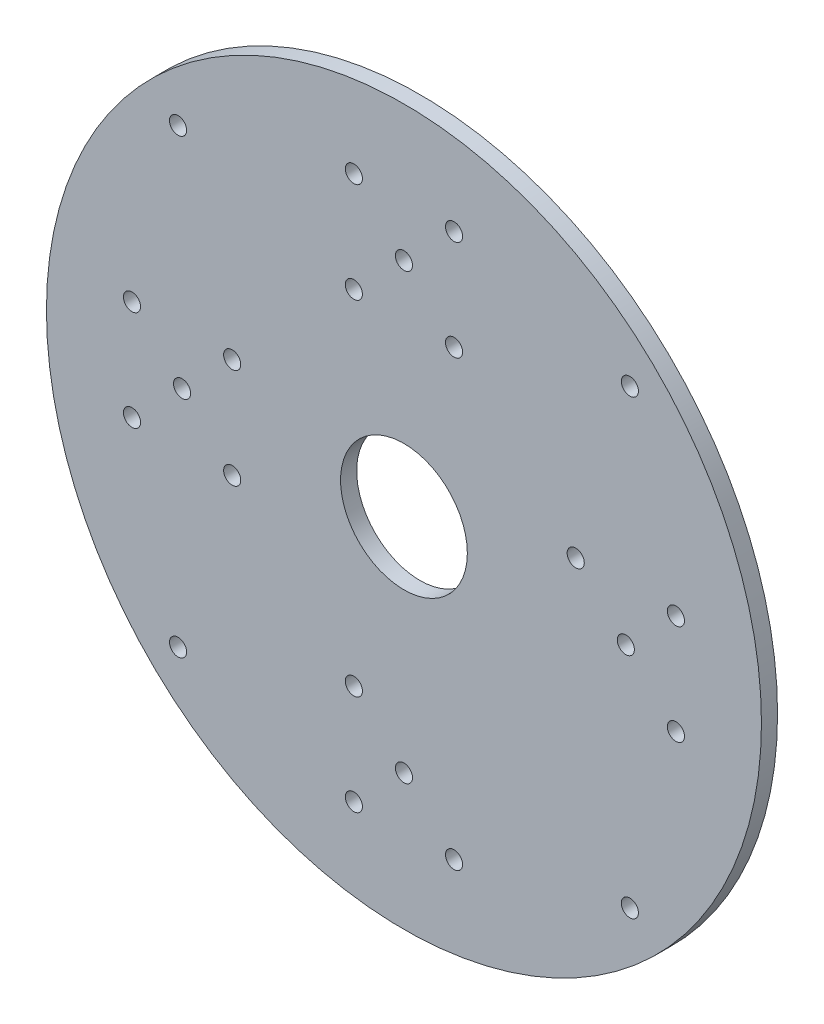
ISO-10303-21;
HEADER;
FILE_DESCRIPTION(('STEP AP214'),'2;1');
FILE_NAME('part.step','',(''),(''),'','','');
FILE_SCHEMA(('AUTOMOTIVE_DESIGN { 1 0 10303 214 1 1 1 1 }'));
ENDSEC;
DATA;
#1=APPLICATION_CONTEXT('core data for automotive mechanical design processes');
#2=APPLICATION_PROTOCOL_DEFINITION('international standard','automotive_design',2000,#1);
#3=PRODUCT_CONTEXT('',#1,'mechanical');
#4=PRODUCT('Part','Part','',(#3));
#5=PRODUCT_RELATED_PRODUCT_CATEGORY('part','',(#4));
#6=PRODUCT_DEFINITION_FORMATION('','',#4);
#7=PRODUCT_DEFINITION_CONTEXT('part definition',#1,'design');
#8=PRODUCT_DEFINITION('design','',#6,#7);
#9=PRODUCT_DEFINITION_SHAPE('','',#8);
#10=(LENGTH_UNIT() NAMED_UNIT(*) SI_UNIT(.MILLI.,.METRE.));
#11=(NAMED_UNIT(*) PLANE_ANGLE_UNIT() SI_UNIT($,.RADIAN.));
#12=(NAMED_UNIT(*) SI_UNIT($,.STERADIAN.) SOLID_ANGLE_UNIT());
#13=UNCERTAINTY_MEASURE_WITH_UNIT(LENGTH_MEASURE(1.E-05),#10,'distance_accuracy_value','');
#14=(GEOMETRIC_REPRESENTATION_CONTEXT(3) GLOBAL_UNCERTAINTY_ASSIGNED_CONTEXT((#13)) GLOBAL_UNIT_ASSIGNED_CONTEXT((#10,
#11,#12)) REPRESENTATION_CONTEXT('',''));
#15=CARTESIAN_POINT('',(0.,0.,0.));
#16=DIRECTION('',(0.,0.,1.));
#17=DIRECTION('',(1.,0.,0.));
#18=AXIS2_PLACEMENT_3D('',#15,#16,#17);
#19=CARTESIAN_POINT('',(0.,0.,6.35));
#20=DIRECTION('',(0.,0.,1.));
#21=DIRECTION('',(1.,0.,0.));
#22=AXIS2_PLACEMENT_3D('',#19,#20,#21);
#23=PLANE('',#22);
#24=CARTESIAN_POINT('',(-9.16513851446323E-13,-87.5,6.35));
#25=DIRECTION('',(0.,0.,1.));
#26=DIRECTION('',(1.,0.,0.));
#27=AXIS2_PLACEMENT_3D('',#24,#25,#26);
#28=CIRCLE('',#27,3.37819999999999);
#29=CARTESIAN_POINT('',(3.37819999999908,-87.5,6.35));
#30=VERTEX_POINT('',#29);
#31=EDGE_CURVE('E285',#30,#30,#28,.T.);
#32=ORIENTED_EDGE('',*,*,#31,.F.);
#33=EDGE_LOOP('',(#32));
#34=FACE_BOUND('',#33,.T.);
#35=CARTESIAN_POINT('',(3.05504617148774E-13,87.5,6.35));
#36=DIRECTION('',(0.,0.,1.));
#37=DIRECTION('',(1.,0.,0.));
#38=AXIS2_PLACEMENT_3D('',#35,#36,#37);
#39=CIRCLE('',#38,3.37819999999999);
#40=CARTESIAN_POINT('',(3.3782000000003,87.5,6.35));
#41=VERTEX_POINT('',#40);
#42=EDGE_CURVE('E93',#41,#41,#39,.T.);
#43=ORIENTED_EDGE('',*,*,#42,.F.);
#44=EDGE_LOOP('',(#43));
#45=FACE_BOUND('',#44,.T.);
#46=CARTESIAN_POINT('',(89.0954544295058,89.0954544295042,6.35));
#47=DIRECTION('',(0.,0.,1.));
#48=DIRECTION('',(1.,0.,0.));
#49=AXIS2_PLACEMENT_3D('',#46,#47,#48);
#50=CIRCLE('',#49,3.37819999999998);
#51=CARTESIAN_POINT('',(92.4736544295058,89.0954544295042,6.35));
#52=VERTEX_POINT('',#51);
#53=EDGE_CURVE('E167',#52,#52,#50,.T.);
#54=ORIENTED_EDGE('',*,*,#53,.F.);
#55=EDGE_LOOP('',(#54));
#56=FACE_BOUND('',#55,.T.);
#57=CARTESIAN_POINT('',(-89.0954544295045,89.0954544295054,6.35));
#58=DIRECTION('',(0.,0.,1.));
#59=DIRECTION('',(1.,0.,0.));
#60=AXIS2_PLACEMENT_3D('',#57,#58,#59);
#61=CIRCLE('',#60,3.3782);
#62=CARTESIAN_POINT('',(-85.7172544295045,89.0954544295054,6.35));
#63=VERTEX_POINT('',#62);
#64=EDGE_CURVE('E172',#63,#63,#61,.T.);
#65=ORIENTED_EDGE('',*,*,#64,.F.);
#66=EDGE_LOOP('',(#65));
#67=FACE_BOUND('',#66,.T.);
#68=CARTESIAN_POINT('',(-89.0954544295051,-89.0954544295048,6.35));
#69=DIRECTION('',(0.,0.,1.));
#70=DIRECTION('',(1.,0.,0.));
#71=AXIS2_PLACEMENT_3D('',#68,#69,#70);
#72=CIRCLE('',#71,3.37819999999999);
#73=CARTESIAN_POINT('',(-85.7172544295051,-89.0954544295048,6.35));
#74=VERTEX_POINT('',#73);
#75=EDGE_CURVE('E178',#74,#74,#72,.T.);
#76=ORIENTED_EDGE('',*,*,#75,.F.);
#77=EDGE_LOOP('',(#76));
#78=FACE_BOUND('',#77,.T.);
#79=CARTESIAN_POINT('',(-19.7565634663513,67.7434365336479,6.35));
#80=DIRECTION('',(0.,0.,1.));
#81=DIRECTION('',(1.,0.,0.));
#82=AXIS2_PLACEMENT_3D('',#79,#80,#81);
#83=CIRCLE('',#82,3.37819999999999);
#84=CARTESIAN_POINT('',(-16.3783634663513,67.7434365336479,6.35));
#85=VERTEX_POINT('',#84);
#86=EDGE_CURVE('E187',#85,#85,#83,.F.);
#87=ORIENTED_EDGE('',*,*,#86,.T.);
#88=EDGE_LOOP('',(#87));
#89=FACE_BOUND('',#88,.T.);
#90=CARTESIAN_POINT('',(0.,0.,6.35));
#91=DIRECTION('',(0.,0.,1.));
#92=DIRECTION('',(1.,0.,0.));
#93=AXIS2_PLACEMENT_3D('',#90,#91,#92);
#94=CIRCLE('',#93,25.);
#95=CARTESIAN_POINT('',(25.,0.,6.35));
#96=VERTEX_POINT('',#95);
#97=EDGE_CURVE('E191',#96,#96,#94,.T.);
#98=ORIENTED_EDGE('',*,*,#97,.F.);
#99=EDGE_LOOP('',(#98));
#100=FACE_BOUND('',#99,.T.);
#101=CARTESIAN_POINT('',(-67.7434365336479,-19.7565634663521,6.35));
#102=DIRECTION('',(0.,0.,1.));
#103=DIRECTION('',(1.,0.,0.));
#104=AXIS2_PLACEMENT_3D('',#101,#102,#103);
#105=CIRCLE('',#104,3.37819999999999);
#106=CARTESIAN_POINT('',(-64.3652365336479,-19.7565634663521,6.35));
#107=VERTEX_POINT('',#106);
#108=EDGE_CURVE('E195',#107,#107,#105,.T.);
#109=ORIENTED_EDGE('',*,*,#108,.F.);
#110=EDGE_LOOP('',(#109));
#111=FACE_BOUND('',#110,.T.);
#112=CARTESIAN_POINT('',(-67.7434365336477,19.7565634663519,6.35));
#113=DIRECTION('',(0.,0.,1.));
#114=DIRECTION('',(1.,0.,0.));
#115=AXIS2_PLACEMENT_3D('',#112,#113,#114);
#116=CIRCLE('',#115,3.37819999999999);
#117=CARTESIAN_POINT('',(-64.3652365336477,19.7565634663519,6.35));
#118=VERTEX_POINT('',#117);
#119=EDGE_CURVE('E199',#118,#118,#116,.T.);
#120=ORIENTED_EDGE('',*,*,#119,.F.);
#121=EDGE_LOOP('',(#120));
#122=FACE_BOUND('',#121,.T.);
#123=CARTESIAN_POINT('',(19.7565634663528,67.7434365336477,6.35));
#124=DIRECTION('',(0.,0.,1.));
#125=DIRECTION('',(1.,0.,0.));
#126=AXIS2_PLACEMENT_3D('',#123,#124,#125);
#127=CIRCLE('',#126,3.37819999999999);
#128=CARTESIAN_POINT('',(23.1347634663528,67.7434365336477,6.35));
#129=VERTEX_POINT('',#128);
#130=EDGE_CURVE('E203',#129,#129,#127,.F.);
#131=ORIENTED_EDGE('',*,*,#130,.T.);
#132=EDGE_LOOP('',(#131));
#133=FACE_BOUND('',#132,.T.);
#134=CARTESIAN_POINT('',(67.7434365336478,19.7565634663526,6.35));
#135=DIRECTION('',(0.,0.,1.));
#136=DIRECTION('',(1.,0.,0.));
#137=AXIS2_PLACEMENT_3D('',#134,#135,#136);
#138=CIRCLE('',#137,3.37819999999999);
#139=CARTESIAN_POINT('',(71.1216365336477,19.7565634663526,6.35));
#140=VERTEX_POINT('',#139);
#141=EDGE_CURVE('E207',#140,#140,#138,.T.);
#142=ORIENTED_EDGE('',*,*,#141,.F.);
#143=EDGE_LOOP('',(#142));
#144=FACE_BOUND('',#143,.T.);
#145=CARTESIAN_POINT('',(-19.7565634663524,-67.7434365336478,6.35));
#146=DIRECTION('',(0.,0.,1.));
#147=DIRECTION('',(1.,0.,0.));
#148=AXIS2_PLACEMENT_3D('',#145,#146,#147);
#149=CIRCLE('',#148,3.37819999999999);
#150=CARTESIAN_POINT('',(-16.3783634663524,-67.7434365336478,6.35));
#151=VERTEX_POINT('',#150);
#152=EDGE_CURVE('E211',#151,#151,#149,.F.);
#153=ORIENTED_EDGE('',*,*,#152,.T.);
#154=EDGE_LOOP('',(#153));
#155=FACE_BOUND('',#154,.T.);
#156=CARTESIAN_POINT('',(19.7565634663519,-107.256563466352,6.35));
#157=DIRECTION('',(0.,0.,1.));
#158=DIRECTION('',(1.,0.,0.));
#159=AXIS2_PLACEMENT_3D('',#156,#157,#158);
#160=CIRCLE('',#159,3.3782);
#161=CARTESIAN_POINT('',(23.1347634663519,-107.256563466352,6.35));
#162=VERTEX_POINT('',#161);
#163=EDGE_CURVE('E215',#162,#162,#160,.F.);
#164=ORIENTED_EDGE('',*,*,#163,.T.);
#165=EDGE_LOOP('',(#164));
#166=FACE_BOUND('',#165,.T.);
#167=CARTESIAN_POINT('',(107.256563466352,-19.7565634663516,6.35));
#168=DIRECTION('',(0.,0.,1.));
#169=DIRECTION('',(1.,0.,0.));
#170=AXIS2_PLACEMENT_3D('',#167,#168,#169);
#171=CIRCLE('',#170,3.37820000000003);
#172=CARTESIAN_POINT('',(110.634763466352,-19.7565634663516,6.35));
#173=VERTEX_POINT('',#172);
#174=EDGE_CURVE('E219',#173,#173,#171,.T.);
#175=ORIENTED_EDGE('',*,*,#174,.F.);
#176=EDGE_LOOP('',(#175));
#177=FACE_BOUND('',#176,.T.);
#178=CARTESIAN_POINT('',(107.256563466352,19.7565634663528,6.35));
#179=DIRECTION('',(0.,0.,1.));
#180=DIRECTION('',(1.,0.,0.));
#181=AXIS2_PLACEMENT_3D('',#178,#179,#180);
#182=CIRCLE('',#181,3.37819999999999);
#183=CARTESIAN_POINT('',(110.634763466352,19.7565634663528,6.35));
#184=VERTEX_POINT('',#183);
#185=EDGE_CURVE('E223',#184,#184,#182,.T.);
#186=ORIENTED_EDGE('',*,*,#185,.F.);
#187=EDGE_LOOP('',(#186));
#188=FACE_BOUND('',#187,.T.);
#189=CARTESIAN_POINT('',(-19.7565634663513,107.256563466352,6.35));
#190=DIRECTION('',(0.,0.,1.));
#191=DIRECTION('',(1.,0.,0.));
#192=AXIS2_PLACEMENT_3D('',#189,#190,#191);
#193=CIRCLE('',#192,3.37820000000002);
#194=CARTESIAN_POINT('',(-16.3783634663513,107.256563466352,6.35));
#195=VERTEX_POINT('',#194);
#196=EDGE_CURVE('E227',#195,#195,#193,.F.);
#197=ORIENTED_EDGE('',*,*,#196,.T.);
#198=EDGE_LOOP('',(#197));
#199=FACE_BOUND('',#198,.T.);
#200=CARTESIAN_POINT('',(-107.256563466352,19.7565634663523,6.35));
#201=DIRECTION('',(0.,0.,1.));
#202=DIRECTION('',(1.,0.,0.));
#203=AXIS2_PLACEMENT_3D('',#200,#201,#202);
#204=CIRCLE('',#203,3.37819999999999);
#205=CARTESIAN_POINT('',(-103.878363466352,19.7565634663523,6.35));
#206=VERTEX_POINT('',#205);
#207=EDGE_CURVE('E231',#206,#206,#204,.T.);
#208=ORIENTED_EDGE('',*,*,#207,.F.);
#209=EDGE_LOOP('',(#208));
#210=FACE_BOUND('',#209,.T.);
#211=CARTESIAN_POINT('',(-107.256563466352,-19.7565634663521,6.35));
#212=DIRECTION('',(0.,0.,1.));
#213=DIRECTION('',(1.,0.,0.));
#214=AXIS2_PLACEMENT_3D('',#211,#212,#213);
#215=CIRCLE('',#214,3.37819999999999);
#216=CARTESIAN_POINT('',(-103.878363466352,-19.7565634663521,6.35));
#217=VERTEX_POINT('',#216);
#218=EDGE_CURVE('E235',#217,#217,#215,.T.);
#219=ORIENTED_EDGE('',*,*,#218,.F.);
#220=EDGE_LOOP('',(#219));
#221=FACE_BOUND('',#220,.T.);
#222=CARTESIAN_POINT('',(89.0954544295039,-89.095454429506,6.35));
#223=DIRECTION('',(0.,0.,1.));
#224=DIRECTION('',(1.,0.,0.));
#225=AXIS2_PLACEMENT_3D('',#222,#223,#224);
#226=CIRCLE('',#225,3.3782);
#227=CARTESIAN_POINT('',(92.4736544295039,-89.095454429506,6.35));
#228=VERTEX_POINT('',#227);
#229=EDGE_CURVE('E239',#228,#228,#226,.T.);
#230=ORIENTED_EDGE('',*,*,#229,.F.);
#231=EDGE_LOOP('',(#230));
#232=FACE_BOUND('',#231,.T.);
#233=CARTESIAN_POINT('',(19.7565634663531,107.256563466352,6.35));
#234=DIRECTION('',(0.,0.,1.));
#235=DIRECTION('',(1.,0.,0.));
#236=AXIS2_PLACEMENT_3D('',#233,#234,#235);
#237=CIRCLE('',#236,3.3782);
#238=CARTESIAN_POINT('',(23.1347634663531,107.256563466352,6.35));
#239=VERTEX_POINT('',#238);
#240=EDGE_CURVE('E84',#239,#239,#237,.F.);
#241=ORIENTED_EDGE('',*,*,#240,.T.);
#242=EDGE_LOOP('',(#241));
#243=FACE_BOUND('',#242,.T.);
#244=CARTESIAN_POINT('',(-19.7565634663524,-107.256563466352,6.35));
#245=DIRECTION('',(0.,0.,1.));
#246=DIRECTION('',(1.,0.,0.));
#247=AXIS2_PLACEMENT_3D('',#244,#245,#246);
#248=CIRCLE('',#247,3.37819999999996);
#249=CARTESIAN_POINT('',(-16.3783634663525,-107.256563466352,6.35));
#250=VERTEX_POINT('',#249);
#251=EDGE_CURVE('E78',#250,#250,#248,.F.);
#252=ORIENTED_EDGE('',*,*,#251,.T.);
#253=EDGE_LOOP('',(#252));
#254=FACE_BOUND('',#253,.T.);
#255=CARTESIAN_POINT('',(0.,0.,6.35));
#256=DIRECTION('',(0.,0.,1.));
#257=DIRECTION('',(1.,0.,0.));
#258=AXIS2_PLACEMENT_3D('',#255,#256,#257);
#259=CIRCLE('',#258,141.);
#260=CARTESIAN_POINT('',(141.,0.,6.35));
#261=VERTEX_POINT('',#260);
#262=EDGE_CURVE('E11',#261,#261,#259,.T.);
#263=ORIENTED_EDGE('',*,*,#262,.T.);
#264=EDGE_LOOP('',(#263));
#265=FACE_BOUND('',#264,.T.);
#266=CARTESIAN_POINT('',(87.5,-6.11009234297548E-13,6.35));
#267=DIRECTION('',(0.,0.,1.));
#268=DIRECTION('',(1.,0.,0.));
#269=AXIS2_PLACEMENT_3D('',#266,#267,#268);
#270=CIRCLE('',#269,3.3782);
#271=CARTESIAN_POINT('',(90.8782,-6.11009234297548E-13,6.35));
#272=VERTEX_POINT('',#271);
#273=EDGE_CURVE('E291',#272,#272,#270,.T.);
#274=ORIENTED_EDGE('',*,*,#273,.F.);
#275=EDGE_LOOP('',(#274));
#276=FACE_BOUND('',#275,.T.);
#277=CARTESIAN_POINT('',(-87.5,0.,6.35));
#278=DIRECTION('',(0.,0.,1.));
#279=DIRECTION('',(1.,0.,0.));
#280=AXIS2_PLACEMENT_3D('',#277,#278,#279);
#281=CIRCLE('',#280,3.3782);
#282=CARTESIAN_POINT('',(-84.1218,0.,6.35));
#283=VERTEX_POINT('',#282);
#284=EDGE_CURVE('E279',#283,#283,#281,.T.);
#285=ORIENTED_EDGE('',*,*,#284,.F.);
#286=EDGE_LOOP('',(#285));
#287=FACE_BOUND('',#286,.T.);
#288=ADVANCED_FACE('F69',(#34,#45,#56,#67,#78,#89,#100,#111,#122,#133,#144,#155,#166,#177,#188,
#199,#210,#221,#232,#243,#254,#265,#276,#287),#23,.T.);
#289=CARTESIAN_POINT('',(0.,0.,0.));
#290=DIRECTION('',(0.,0.,1.));
#291=DIRECTION('',(1.,0.,0.));
#292=AXIS2_PLACEMENT_3D('',#289,#290,#291);
#293=PLANE('',#292);
#294=CARTESIAN_POINT('',(89.0954544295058,89.0954544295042,0.));
#295=DIRECTION('',(0.,0.,1.));
#296=DIRECTION('',(1.,0.,0.));
#297=AXIS2_PLACEMENT_3D('',#294,#295,#296);
#298=CIRCLE('',#297,3.37819999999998);
#299=CARTESIAN_POINT('',(92.4736544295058,89.0954544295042,0.));
#300=VERTEX_POINT('',#299);
#301=EDGE_CURVE('E88',#300,#300,#298,.T.);
#302=ORIENTED_EDGE('',*,*,#301,.T.);
#303=EDGE_LOOP('',(#302));
#304=FACE_BOUND('',#303,.T.);
#305=CARTESIAN_POINT('',(-89.0954544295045,89.0954544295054,0.));
#306=DIRECTION('',(0.,0.,1.));
#307=DIRECTION('',(1.,0.,0.));
#308=AXIS2_PLACEMENT_3D('',#305,#306,#307);
#309=CIRCLE('',#308,3.3782);
#310=CARTESIAN_POINT('',(-85.7172544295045,89.0954544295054,0.));
#311=VERTEX_POINT('',#310);
#312=EDGE_CURVE('E92',#311,#311,#309,.T.);
#313=ORIENTED_EDGE('',*,*,#312,.T.);
#314=EDGE_LOOP('',(#313));
#315=FACE_BOUND('',#314,.T.);
#316=CARTESIAN_POINT('',(-89.0954544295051,-89.0954544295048,0.));
#317=DIRECTION('',(0.,0.,1.));
#318=DIRECTION('',(1.,0.,0.));
#319=AXIS2_PLACEMENT_3D('',#316,#317,#318);
#320=CIRCLE('',#319,3.37819999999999);
#321=CARTESIAN_POINT('',(-85.7172544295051,-89.0954544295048,0.));
#322=VERTEX_POINT('',#321);
#323=EDGE_CURVE('E97',#322,#322,#320,.T.);
#324=ORIENTED_EDGE('',*,*,#323,.T.);
#325=EDGE_LOOP('',(#324));
#326=FACE_BOUND('',#325,.T.);
#327=CARTESIAN_POINT('',(-19.7565634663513,67.7434365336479,0.));
#328=DIRECTION('',(0.,0.,1.));
#329=DIRECTION('',(1.,0.,0.));
#330=AXIS2_PLACEMENT_3D('',#327,#328,#329);
#331=CIRCLE('',#330,3.37819999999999);
#332=CARTESIAN_POINT('',(-16.3783634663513,67.7434365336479,0.));
#333=VERTEX_POINT('',#332);
#334=EDGE_CURVE('E101',#333,#333,#331,.F.);
#335=ORIENTED_EDGE('',*,*,#334,.F.);
#336=EDGE_LOOP('',(#335));
#337=FACE_BOUND('',#336,.T.);
#338=CARTESIAN_POINT('',(0.,0.,0.));
#339=DIRECTION('',(0.,0.,1.));
#340=DIRECTION('',(1.,0.,0.));
#341=AXIS2_PLACEMENT_3D('',#338,#339,#340);
#342=CIRCLE('',#341,25.);
#343=CARTESIAN_POINT('',(25.,0.,0.));
#344=VERTEX_POINT('',#343);
#345=EDGE_CURVE('E105',#344,#344,#342,.T.);
#346=ORIENTED_EDGE('',*,*,#345,.T.);
#347=EDGE_LOOP('',(#346));
#348=FACE_BOUND('',#347,.T.);
#349=CARTESIAN_POINT('',(-67.7434365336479,-19.7565634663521,0.));
#350=DIRECTION('',(0.,0.,1.));
#351=DIRECTION('',(1.,0.,0.));
#352=AXIS2_PLACEMENT_3D('',#349,#350,#351);
#353=CIRCLE('',#352,3.37819999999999);
#354=CARTESIAN_POINT('',(-64.3652365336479,-19.7565634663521,0.));
#355=VERTEX_POINT('',#354);
#356=EDGE_CURVE('E109',#355,#355,#353,.T.);
#357=ORIENTED_EDGE('',*,*,#356,.T.);
#358=EDGE_LOOP('',(#357));
#359=FACE_BOUND('',#358,.T.);
#360=CARTESIAN_POINT('',(-67.7434365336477,19.7565634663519,0.));
#361=DIRECTION('',(0.,0.,1.));
#362=DIRECTION('',(1.,0.,0.));
#363=AXIS2_PLACEMENT_3D('',#360,#361,#362);
#364=CIRCLE('',#363,3.37819999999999);
#365=CARTESIAN_POINT('',(-64.3652365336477,19.7565634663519,0.));
#366=VERTEX_POINT('',#365);
#367=EDGE_CURVE('E113',#366,#366,#364,.T.);
#368=ORIENTED_EDGE('',*,*,#367,.T.);
#369=EDGE_LOOP('',(#368));
#370=FACE_BOUND('',#369,.T.);
#371=CARTESIAN_POINT('',(19.7565634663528,67.7434365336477,0.));
#372=DIRECTION('',(0.,0.,1.));
#373=DIRECTION('',(1.,0.,0.));
#374=AXIS2_PLACEMENT_3D('',#371,#372,#373);
#375=CIRCLE('',#374,3.37819999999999);
#376=CARTESIAN_POINT('',(23.1347634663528,67.7434365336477,0.));
#377=VERTEX_POINT('',#376);
#378=EDGE_CURVE('E117',#377,#377,#375,.F.);
#379=ORIENTED_EDGE('',*,*,#378,.F.);
#380=EDGE_LOOP('',(#379));
#381=FACE_BOUND('',#380,.T.);
#382=CARTESIAN_POINT('',(67.7434365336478,19.7565634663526,0.));
#383=DIRECTION('',(0.,0.,1.));
#384=DIRECTION('',(1.,0.,0.));
#385=AXIS2_PLACEMENT_3D('',#382,#383,#384);
#386=CIRCLE('',#385,3.37819999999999);
#387=CARTESIAN_POINT('',(71.1216365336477,19.7565634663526,0.));
#388=VERTEX_POINT('',#387);
#389=EDGE_CURVE('E121',#388,#388,#386,.T.);
#390=ORIENTED_EDGE('',*,*,#389,.T.);
#391=EDGE_LOOP('',(#390));
#392=FACE_BOUND('',#391,.T.);
#393=CARTESIAN_POINT('',(-19.7565634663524,-67.7434365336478,0.));
#394=DIRECTION('',(0.,0.,1.));
#395=DIRECTION('',(1.,0.,0.));
#396=AXIS2_PLACEMENT_3D('',#393,#394,#395);
#397=CIRCLE('',#396,3.37819999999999);
#398=CARTESIAN_POINT('',(-16.3783634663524,-67.7434365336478,0.));
#399=VERTEX_POINT('',#398);
#400=EDGE_CURVE('E125',#399,#399,#397,.F.);
#401=ORIENTED_EDGE('',*,*,#400,.F.);
#402=EDGE_LOOP('',(#401));
#403=FACE_BOUND('',#402,.T.);
#404=CARTESIAN_POINT('',(19.7565634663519,-107.256563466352,0.));
#405=DIRECTION('',(0.,0.,1.));
#406=DIRECTION('',(1.,0.,0.));
#407=AXIS2_PLACEMENT_3D('',#404,#405,#406);
#408=CIRCLE('',#407,3.3782);
#409=CARTESIAN_POINT('',(23.1347634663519,-107.256563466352,0.));
#410=VERTEX_POINT('',#409);
#411=EDGE_CURVE('E129',#410,#410,#408,.F.);
#412=ORIENTED_EDGE('',*,*,#411,.F.);
#413=EDGE_LOOP('',(#412));
#414=FACE_BOUND('',#413,.T.);
#415=CARTESIAN_POINT('',(107.256563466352,-19.7565634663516,0.));
#416=DIRECTION('',(0.,0.,1.));
#417=DIRECTION('',(1.,0.,0.));
#418=AXIS2_PLACEMENT_3D('',#415,#416,#417);
#419=CIRCLE('',#418,3.37820000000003);
#420=CARTESIAN_POINT('',(110.634763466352,-19.7565634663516,0.));
#421=VERTEX_POINT('',#420);
#422=EDGE_CURVE('E133',#421,#421,#419,.T.);
#423=ORIENTED_EDGE('',*,*,#422,.T.);
#424=EDGE_LOOP('',(#423));
#425=FACE_BOUND('',#424,.T.);
#426=CARTESIAN_POINT('',(107.256563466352,19.7565634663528,0.));
#427=DIRECTION('',(0.,0.,1.));
#428=DIRECTION('',(1.,0.,0.));
#429=AXIS2_PLACEMENT_3D('',#426,#427,#428);
#430=CIRCLE('',#429,3.37819999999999);
#431=CARTESIAN_POINT('',(110.634763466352,19.7565634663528,0.));
#432=VERTEX_POINT('',#431);
#433=EDGE_CURVE('E137',#432,#432,#430,.T.);
#434=ORIENTED_EDGE('',*,*,#433,.T.);
#435=EDGE_LOOP('',(#434));
#436=FACE_BOUND('',#435,.T.);
#437=CARTESIAN_POINT('',(-19.7565634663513,107.256563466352,0.));
#438=DIRECTION('',(0.,0.,1.));
#439=DIRECTION('',(1.,0.,0.));
#440=AXIS2_PLACEMENT_3D('',#437,#438,#439);
#441=CIRCLE('',#440,3.37820000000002);
#442=CARTESIAN_POINT('',(-16.3783634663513,107.256563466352,0.));
#443=VERTEX_POINT('',#442);
#444=EDGE_CURVE('E141',#443,#443,#441,.F.);
#445=ORIENTED_EDGE('',*,*,#444,.F.);
#446=EDGE_LOOP('',(#445));
#447=FACE_BOUND('',#446,.T.);
#448=CARTESIAN_POINT('',(-107.256563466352,19.7565634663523,0.));
#449=DIRECTION('',(0.,0.,1.));
#450=DIRECTION('',(1.,0.,0.));
#451=AXIS2_PLACEMENT_3D('',#448,#449,#450);
#452=CIRCLE('',#451,3.37819999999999);
#453=CARTESIAN_POINT('',(-103.878363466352,19.7565634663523,0.));
#454=VERTEX_POINT('',#453);
#455=EDGE_CURVE('E145',#454,#454,#452,.T.);
#456=ORIENTED_EDGE('',*,*,#455,.T.);
#457=EDGE_LOOP('',(#456));
#458=FACE_BOUND('',#457,.T.);
#459=CARTESIAN_POINT('',(-107.256563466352,-19.7565634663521,0.));
#460=DIRECTION('',(0.,0.,1.));
#461=DIRECTION('',(1.,0.,0.));
#462=AXIS2_PLACEMENT_3D('',#459,#460,#461);
#463=CIRCLE('',#462,3.37819999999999);
#464=CARTESIAN_POINT('',(-103.878363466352,-19.7565634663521,0.));
#465=VERTEX_POINT('',#464);
#466=EDGE_CURVE('E149',#465,#465,#463,.T.);
#467=ORIENTED_EDGE('',*,*,#466,.T.);
#468=EDGE_LOOP('',(#467));
#469=FACE_BOUND('',#468,.T.);
#470=CARTESIAN_POINT('',(89.0954544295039,-89.095454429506,0.));
#471=DIRECTION('',(0.,0.,1.));
#472=DIRECTION('',(1.,0.,0.));
#473=AXIS2_PLACEMENT_3D('',#470,#471,#472);
#474=CIRCLE('',#473,3.3782);
#475=CARTESIAN_POINT('',(92.4736544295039,-89.095454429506,0.));
#476=VERTEX_POINT('',#475);
#477=EDGE_CURVE('E153',#476,#476,#474,.T.);
#478=ORIENTED_EDGE('',*,*,#477,.T.);
#479=EDGE_LOOP('',(#478));
#480=FACE_BOUND('',#479,.T.);
#481=CARTESIAN_POINT('',(19.7565634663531,107.256563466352,0.));
#482=DIRECTION('',(0.,0.,1.));
#483=DIRECTION('',(1.,0.,0.));
#484=AXIS2_PLACEMENT_3D('',#481,#482,#483);
#485=CIRCLE('',#484,3.3782);
#486=CARTESIAN_POINT('',(23.1347634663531,107.256563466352,0.));
#487=VERTEX_POINT('',#486);
#488=EDGE_CURVE('E157',#487,#487,#485,.F.);
#489=ORIENTED_EDGE('',*,*,#488,.F.);
#490=EDGE_LOOP('',(#489));
#491=FACE_BOUND('',#490,.T.);
#492=CARTESIAN_POINT('',(-19.7565634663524,-107.256563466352,0.));
#493=DIRECTION('',(0.,0.,1.));
#494=DIRECTION('',(1.,0.,0.));
#495=AXIS2_PLACEMENT_3D('',#492,#493,#494);
#496=CIRCLE('',#495,3.37819999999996);
#497=CARTESIAN_POINT('',(-16.3783634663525,-107.256563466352,0.));
#498=VERTEX_POINT('',#497);
#499=EDGE_CURVE('E160',#498,#498,#496,.F.);
#500=ORIENTED_EDGE('',*,*,#499,.F.);
#501=EDGE_LOOP('',(#500));
#502=FACE_BOUND('',#501,.T.);
#503=CARTESIAN_POINT('',(0.,0.,0.));
#504=DIRECTION('',(0.,0.,1.));
#505=DIRECTION('',(1.,0.,0.));
#506=AXIS2_PLACEMENT_3D('',#503,#504,#505);
#507=CIRCLE('',#506,141.);
#508=CARTESIAN_POINT('',(141.,0.,0.));
#509=VERTEX_POINT('',#508);
#510=EDGE_CURVE('E73',#509,#509,#507,.T.);
#511=ORIENTED_EDGE('',*,*,#510,.F.);
#512=EDGE_LOOP('',(#511));
#513=FACE_BOUND('',#512,.T.);
#514=CARTESIAN_POINT('',(3.05504617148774E-13,87.5,0.));
#515=DIRECTION('',(0.,0.,1.));
#516=DIRECTION('',(1.,0.,0.));
#517=AXIS2_PLACEMENT_3D('',#514,#515,#516);
#518=CIRCLE('',#517,3.37819999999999);
#519=CARTESIAN_POINT('',(3.3782000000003,87.5,0.));
#520=VERTEX_POINT('',#519);
#521=EDGE_CURVE('E181',#520,#520,#518,.T.);
#522=ORIENTED_EDGE('',*,*,#521,.T.);
#523=EDGE_LOOP('',(#522));
#524=FACE_BOUND('',#523,.T.);
#525=CARTESIAN_POINT('',(87.5,-6.11009234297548E-13,0.));
#526=DIRECTION('',(0.,0.,1.));
#527=DIRECTION('',(1.,0.,0.));
#528=AXIS2_PLACEMENT_3D('',#525,#526,#527);
#529=CIRCLE('',#528,3.3782);
#530=CARTESIAN_POINT('',(90.8782,-6.11009234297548E-13,0.));
#531=VERTEX_POINT('',#530);
#532=EDGE_CURVE('E269',#531,#531,#529,.T.);
#533=ORIENTED_EDGE('',*,*,#532,.T.);
#534=EDGE_LOOP('',(#533));
#535=FACE_BOUND('',#534,.T.);
#536=CARTESIAN_POINT('',(-9.16513851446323E-13,-87.5,0.));
#537=DIRECTION('',(0.,0.,1.));
#538=DIRECTION('',(1.,0.,0.));
#539=AXIS2_PLACEMENT_3D('',#536,#537,#538);
#540=CIRCLE('',#539,3.37819999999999);
#541=CARTESIAN_POINT('',(3.37819999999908,-87.5,0.));
#542=VERTEX_POINT('',#541);
#543=EDGE_CURVE('E273',#542,#542,#540,.T.);
#544=ORIENTED_EDGE('',*,*,#543,.T.);
#545=EDGE_LOOP('',(#544));
#546=FACE_BOUND('',#545,.T.);
#547=CARTESIAN_POINT('',(-87.5,0.,0.));
#548=DIRECTION('',(0.,0.,1.));
#549=DIRECTION('',(1.,0.,0.));
#550=AXIS2_PLACEMENT_3D('',#547,#548,#549);
#551=CIRCLE('',#550,3.3782);
#552=CARTESIAN_POINT('',(-84.1218,0.,0.));
#553=VERTEX_POINT('',#552);
#554=EDGE_CURVE('E276',#553,#553,#551,.T.);
#555=ORIENTED_EDGE('',*,*,#554,.T.);
#556=EDGE_LOOP('',(#555));
#557=FACE_BOUND('',#556,.T.);
#558=ADVANCED_FACE('F256',(#304,#315,#326,#337,#348,#359,#370,#381,#392,#403,#414,#425,#436,
#447,#458,#469,#480,#491,#502,#513,#524,#535,#546,#557),#293,.F.);
#559=CARTESIAN_POINT('',(-19.7565634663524,-107.256563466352,6.35));
#560=DIRECTION('',(0.,0.,-1.));
#561=DIRECTION('',(-1.,0.,0.));
#562=AXIS2_PLACEMENT_3D('',#559,#560,#561);
#563=CYLINDRICAL_SURFACE('',#562,3.37819999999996);
#564=ORIENTED_EDGE('',*,*,#251,.F.);
#565=EDGE_LOOP('',(#564));
#566=FACE_BOUND('',#565,.T.);
#567=ORIENTED_EDGE('',*,*,#499,.T.);
#568=EDGE_LOOP('',(#567));
#569=FACE_BOUND('',#568,.T.);
#570=ADVANCED_FACE('F252',(#566,#569),#563,.F.);
#571=CARTESIAN_POINT('',(19.7565634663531,107.256563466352,6.35));
#572=DIRECTION('',(0.,0.,-1.));
#573=DIRECTION('',(-1.,0.,0.));
#574=AXIS2_PLACEMENT_3D('',#571,#572,#573);
#575=CYLINDRICAL_SURFACE('',#574,3.3782);
#576=ORIENTED_EDGE('',*,*,#240,.F.);
#577=EDGE_LOOP('',(#576));
#578=FACE_BOUND('',#577,.T.);
#579=ORIENTED_EDGE('',*,*,#488,.T.);
#580=EDGE_LOOP('',(#579));
#581=FACE_BOUND('',#580,.T.);
#582=ADVANCED_FACE('F248',(#578,#581),#575,.F.);
#583=CARTESIAN_POINT('',(89.0954544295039,-89.095454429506,6.35));
#584=DIRECTION('',(0.,0.,-1.));
#585=DIRECTION('',(-1.,0.,0.));
#586=AXIS2_PLACEMENT_3D('',#583,#584,#585);
#587=CYLINDRICAL_SURFACE('',#586,3.3782);
#588=ORIENTED_EDGE('',*,*,#229,.T.);
#589=EDGE_LOOP('',(#588));
#590=FACE_BOUND('',#589,.T.);
#591=ORIENTED_EDGE('',*,*,#477,.F.);
#592=EDGE_LOOP('',(#591));
#593=FACE_BOUND('',#592,.T.);
#594=ADVANCED_FACE('F251',(#590,#593),#587,.F.);
#595=CARTESIAN_POINT('',(-107.256563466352,-19.7565634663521,6.35));
#596=DIRECTION('',(0.,0.,-1.));
#597=DIRECTION('',(-1.,0.,0.));
#598=AXIS2_PLACEMENT_3D('',#595,#596,#597);
#599=CYLINDRICAL_SURFACE('',#598,3.37819999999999);
#600=ORIENTED_EDGE('',*,*,#218,.T.);
#601=EDGE_LOOP('',(#600));
#602=FACE_BOUND('',#601,.T.);
#603=ORIENTED_EDGE('',*,*,#466,.F.);
#604=EDGE_LOOP('',(#603));
#605=FACE_BOUND('',#604,.T.);
#606=ADVANCED_FACE('F343',(#602,#605),#599,.F.);
#607=CARTESIAN_POINT('',(-107.256563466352,19.7565634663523,6.35));
#608=DIRECTION('',(0.,0.,-1.));
#609=DIRECTION('',(-1.,0.,0.));
#610=AXIS2_PLACEMENT_3D('',#607,#608,#609);
#611=CYLINDRICAL_SURFACE('',#610,3.37819999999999);
#612=ORIENTED_EDGE('',*,*,#207,.T.);
#613=EDGE_LOOP('',(#612));
#614=FACE_BOUND('',#613,.T.);
#615=ORIENTED_EDGE('',*,*,#455,.F.);
#616=EDGE_LOOP('',(#615));
#617=FACE_BOUND('',#616,.T.);
#618=ADVANCED_FACE('F350',(#614,#617),#611,.F.);
#619=CARTESIAN_POINT('',(-19.7565634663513,107.256563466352,6.35));
#620=DIRECTION('',(0.,0.,-1.));
#621=DIRECTION('',(-1.,0.,0.));
#622=AXIS2_PLACEMENT_3D('',#619,#620,#621);
#623=CYLINDRICAL_SURFACE('',#622,3.37820000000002);
#624=ORIENTED_EDGE('',*,*,#196,.F.);
#625=EDGE_LOOP('',(#624));
#626=FACE_BOUND('',#625,.T.);
#627=ORIENTED_EDGE('',*,*,#444,.T.);
#628=EDGE_LOOP('',(#627));
#629=FACE_BOUND('',#628,.T.);
#630=ADVANCED_FACE('F357',(#626,#629),#623,.F.);
#631=CARTESIAN_POINT('',(107.256563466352,19.7565634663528,6.35));
#632=DIRECTION('',(0.,0.,-1.));
#633=DIRECTION('',(-1.,0.,0.));
#634=AXIS2_PLACEMENT_3D('',#631,#632,#633);
#635=CYLINDRICAL_SURFACE('',#634,3.37819999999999);
#636=ORIENTED_EDGE('',*,*,#185,.T.);
#637=EDGE_LOOP('',(#636));
#638=FACE_BOUND('',#637,.T.);
#639=ORIENTED_EDGE('',*,*,#433,.F.);
#640=EDGE_LOOP('',(#639));
#641=FACE_BOUND('',#640,.T.);
#642=ADVANCED_FACE('F361',(#638,#641),#635,.F.);
#643=CARTESIAN_POINT('',(107.256563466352,-19.7565634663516,6.35));
#644=DIRECTION('',(0.,0.,-1.));
#645=DIRECTION('',(-1.,0.,0.));
#646=AXIS2_PLACEMENT_3D('',#643,#644,#645);
#647=CYLINDRICAL_SURFACE('',#646,3.37820000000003);
#648=ORIENTED_EDGE('',*,*,#174,.T.);
#649=EDGE_LOOP('',(#648));
#650=FACE_BOUND('',#649,.T.);
#651=ORIENTED_EDGE('',*,*,#422,.F.);
#652=EDGE_LOOP('',(#651));
#653=FACE_BOUND('',#652,.T.);
#654=ADVANCED_FACE('F365',(#650,#653),#647,.F.);
#655=CARTESIAN_POINT('',(19.7565634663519,-107.256563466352,6.35));
#656=DIRECTION('',(0.,0.,-1.));
#657=DIRECTION('',(-1.,0.,0.));
#658=AXIS2_PLACEMENT_3D('',#655,#656,#657);
#659=CYLINDRICAL_SURFACE('',#658,3.3782);
#660=ORIENTED_EDGE('',*,*,#163,.F.);
#661=EDGE_LOOP('',(#660));
#662=FACE_BOUND('',#661,.T.);
#663=ORIENTED_EDGE('',*,*,#411,.T.);
#664=EDGE_LOOP('',(#663));
#665=FACE_BOUND('',#664,.T.);
#666=ADVANCED_FACE('F369',(#662,#665),#659,.F.);
#667=CARTESIAN_POINT('',(-19.7565634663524,-67.7434365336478,6.35));
#668=DIRECTION('',(0.,0.,-1.));
#669=DIRECTION('',(-1.,0.,0.));
#670=AXIS2_PLACEMENT_3D('',#667,#668,#669);
#671=CYLINDRICAL_SURFACE('',#670,3.37819999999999);
#672=ORIENTED_EDGE('',*,*,#152,.F.);
#673=EDGE_LOOP('',(#672));
#674=FACE_BOUND('',#673,.T.);
#675=ORIENTED_EDGE('',*,*,#400,.T.);
#676=EDGE_LOOP('',(#675));
#677=FACE_BOUND('',#676,.T.);
#678=ADVANCED_FACE('F373',(#674,#677),#671,.F.);
#679=CARTESIAN_POINT('',(67.7434365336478,19.7565634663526,6.35));
#680=DIRECTION('',(0.,0.,-1.));
#681=DIRECTION('',(-1.,0.,0.));
#682=AXIS2_PLACEMENT_3D('',#679,#680,#681);
#683=CYLINDRICAL_SURFACE('',#682,3.37819999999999);
#684=ORIENTED_EDGE('',*,*,#141,.T.);
#685=EDGE_LOOP('',(#684));
#686=FACE_BOUND('',#685,.T.);
#687=ORIENTED_EDGE('',*,*,#389,.F.);
#688=EDGE_LOOP('',(#687));
#689=FACE_BOUND('',#688,.T.);
#690=ADVANCED_FACE('F377',(#686,#689),#683,.F.);
#691=CARTESIAN_POINT('',(19.7565634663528,67.7434365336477,6.35));
#692=DIRECTION('',(0.,0.,-1.));
#693=DIRECTION('',(-1.,0.,0.));
#694=AXIS2_PLACEMENT_3D('',#691,#692,#693);
#695=CYLINDRICAL_SURFACE('',#694,3.37819999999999);
#696=ORIENTED_EDGE('',*,*,#130,.F.);
#697=EDGE_LOOP('',(#696));
#698=FACE_BOUND('',#697,.T.);
#699=ORIENTED_EDGE('',*,*,#378,.T.);
#700=EDGE_LOOP('',(#699));
#701=FACE_BOUND('',#700,.T.);
#702=ADVANCED_FACE('F381',(#698,#701),#695,.F.);
#703=CARTESIAN_POINT('',(-67.7434365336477,19.7565634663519,6.35));
#704=DIRECTION('',(0.,0.,-1.));
#705=DIRECTION('',(-1.,0.,0.));
#706=AXIS2_PLACEMENT_3D('',#703,#704,#705);
#707=CYLINDRICAL_SURFACE('',#706,3.37819999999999);
#708=ORIENTED_EDGE('',*,*,#119,.T.);
#709=EDGE_LOOP('',(#708));
#710=FACE_BOUND('',#709,.T.);
#711=ORIENTED_EDGE('',*,*,#367,.F.);
#712=EDGE_LOOP('',(#711));
#713=FACE_BOUND('',#712,.T.);
#714=ADVANCED_FACE('F385',(#710,#713),#707,.F.);
#715=CARTESIAN_POINT('',(-67.7434365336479,-19.7565634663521,6.35));
#716=DIRECTION('',(0.,0.,-1.));
#717=DIRECTION('',(-1.,0.,0.));
#718=AXIS2_PLACEMENT_3D('',#715,#716,#717);
#719=CYLINDRICAL_SURFACE('',#718,3.37819999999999);
#720=ORIENTED_EDGE('',*,*,#108,.T.);
#721=EDGE_LOOP('',(#720));
#722=FACE_BOUND('',#721,.T.);
#723=ORIENTED_EDGE('',*,*,#356,.F.);
#724=EDGE_LOOP('',(#723));
#725=FACE_BOUND('',#724,.T.);
#726=ADVANCED_FACE('F389',(#722,#725),#719,.F.);
#727=CARTESIAN_POINT('',(0.,0.,6.35));
#728=DIRECTION('',(0.,0.,-1.));
#729=DIRECTION('',(-1.,0.,0.));
#730=AXIS2_PLACEMENT_3D('',#727,#728,#729);
#731=CYLINDRICAL_SURFACE('',#730,25.);
#732=ORIENTED_EDGE('',*,*,#97,.T.);
#733=EDGE_LOOP('',(#732));
#734=FACE_BOUND('',#733,.T.);
#735=ORIENTED_EDGE('',*,*,#345,.F.);
#736=EDGE_LOOP('',(#735));
#737=FACE_BOUND('',#736,.T.);
#738=ADVANCED_FACE('F393',(#734,#737),#731,.F.);
#739=CARTESIAN_POINT('',(-19.7565634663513,67.7434365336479,6.35));
#740=DIRECTION('',(0.,0.,-1.));
#741=DIRECTION('',(-1.,0.,0.));
#742=AXIS2_PLACEMENT_3D('',#739,#740,#741);
#743=CYLINDRICAL_SURFACE('',#742,3.37819999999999);
#744=ORIENTED_EDGE('',*,*,#86,.F.);
#745=EDGE_LOOP('',(#744));
#746=FACE_BOUND('',#745,.T.);
#747=ORIENTED_EDGE('',*,*,#334,.T.);
#748=EDGE_LOOP('',(#747));
#749=FACE_BOUND('',#748,.T.);
#750=ADVANCED_FACE('F397',(#746,#749),#743,.F.);
#751=CARTESIAN_POINT('',(-89.0954544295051,-89.0954544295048,6.35));
#752=DIRECTION('',(0.,0.,-1.));
#753=DIRECTION('',(-1.,0.,0.));
#754=AXIS2_PLACEMENT_3D('',#751,#752,#753);
#755=CYLINDRICAL_SURFACE('',#754,3.37819999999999);
#756=ORIENTED_EDGE('',*,*,#75,.T.);
#757=EDGE_LOOP('',(#756));
#758=FACE_BOUND('',#757,.T.);
#759=ORIENTED_EDGE('',*,*,#323,.F.);
#760=EDGE_LOOP('',(#759));
#761=FACE_BOUND('',#760,.T.);
#762=ADVANCED_FACE('F401',(#758,#761),#755,.F.);
#763=CARTESIAN_POINT('',(-89.0954544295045,89.0954544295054,6.35));
#764=DIRECTION('',(0.,0.,-1.));
#765=DIRECTION('',(-1.,0.,0.));
#766=AXIS2_PLACEMENT_3D('',#763,#764,#765);
#767=CYLINDRICAL_SURFACE('',#766,3.3782);
#768=ORIENTED_EDGE('',*,*,#64,.T.);
#769=EDGE_LOOP('',(#768));
#770=FACE_BOUND('',#769,.T.);
#771=ORIENTED_EDGE('',*,*,#312,.F.);
#772=EDGE_LOOP('',(#771));
#773=FACE_BOUND('',#772,.T.);
#774=ADVANCED_FACE('F404',(#770,#773),#767,.F.);
#775=CARTESIAN_POINT('',(89.0954544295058,89.0954544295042,6.35));
#776=DIRECTION('',(0.,0.,-1.));
#777=DIRECTION('',(-1.,0.,0.));
#778=AXIS2_PLACEMENT_3D('',#775,#776,#777);
#779=CYLINDRICAL_SURFACE('',#778,3.37819999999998);
#780=ORIENTED_EDGE('',*,*,#53,.T.);
#781=EDGE_LOOP('',(#780));
#782=FACE_BOUND('',#781,.T.);
#783=ORIENTED_EDGE('',*,*,#301,.F.);
#784=EDGE_LOOP('',(#783));
#785=FACE_BOUND('',#784,.T.);
#786=ADVANCED_FACE('F71',(#782,#785),#779,.F.);
#787=CARTESIAN_POINT('',(0.,0.,6.35));
#788=DIRECTION('',(0.,0.,-1.));
#789=DIRECTION('',(-1.,0.,0.));
#790=AXIS2_PLACEMENT_3D('',#787,#788,#789);
#791=CYLINDRICAL_SURFACE('',#790,141.);
#792=ORIENTED_EDGE('',*,*,#262,.F.);
#793=EDGE_LOOP('',(#792));
#794=FACE_BOUND('',#793,.T.);
#795=ORIENTED_EDGE('',*,*,#510,.T.);
#796=EDGE_LOOP('',(#795));
#797=FACE_BOUND('',#796,.T.);
#798=ADVANCED_FACE('F411',(#794,#797),#791,.T.);
#799=CARTESIAN_POINT('',(3.05504617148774E-13,87.5,6.35));
#800=DIRECTION('',(0.,0.,-1.));
#801=DIRECTION('',(-1.,0.,0.));
#802=AXIS2_PLACEMENT_3D('',#799,#800,#801);
#803=CYLINDRICAL_SURFACE('',#802,3.37819999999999);
#804=ORIENTED_EDGE('',*,*,#42,.T.);
#805=EDGE_LOOP('',(#804));
#806=FACE_BOUND('',#805,.T.);
#807=ORIENTED_EDGE('',*,*,#521,.F.);
#808=EDGE_LOOP('',(#807));
#809=FACE_BOUND('',#808,.T.);
#810=ADVANCED_FACE('F301',(#806,#809),#803,.F.);
#811=CARTESIAN_POINT('',(87.5,-6.11009234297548E-13,6.35));
#812=DIRECTION('',(0.,0.,-1.));
#813=DIRECTION('',(-1.,0.,0.));
#814=AXIS2_PLACEMENT_3D('',#811,#812,#813);
#815=CYLINDRICAL_SURFACE('',#814,3.3782);
#816=ORIENTED_EDGE('',*,*,#273,.T.);
#817=EDGE_LOOP('',(#816));
#818=FACE_BOUND('',#817,.T.);
#819=ORIENTED_EDGE('',*,*,#532,.F.);
#820=EDGE_LOOP('',(#819));
#821=FACE_BOUND('',#820,.T.);
#822=ADVANCED_FACE('F467',(#818,#821),#815,.F.);
#823=CARTESIAN_POINT('',(-9.16513851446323E-13,-87.5,6.35));
#824=DIRECTION('',(0.,0.,-1.));
#825=DIRECTION('',(-1.,0.,0.));
#826=AXIS2_PLACEMENT_3D('',#823,#824,#825);
#827=CYLINDRICAL_SURFACE('',#826,3.37819999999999);
#828=ORIENTED_EDGE('',*,*,#31,.T.);
#829=EDGE_LOOP('',(#828));
#830=FACE_BOUND('',#829,.T.);
#831=ORIENTED_EDGE('',*,*,#543,.F.);
#832=EDGE_LOOP('',(#831));
#833=FACE_BOUND('',#832,.T.);
#834=ADVANCED_FACE('F481',(#830,#833),#827,.F.);
#835=CARTESIAN_POINT('',(-87.5,0.,6.35));
#836=DIRECTION('',(0.,0.,-1.));
#837=DIRECTION('',(-1.,0.,0.));
#838=AXIS2_PLACEMENT_3D('',#835,#836,#837);
#839=CYLINDRICAL_SURFACE('',#838,3.3782);
#840=ORIENTED_EDGE('',*,*,#284,.T.);
#841=EDGE_LOOP('',(#840));
#842=FACE_BOUND('',#841,.T.);
#843=ORIENTED_EDGE('',*,*,#554,.F.);
#844=EDGE_LOOP('',(#843));
#845=FACE_BOUND('',#844,.T.);
#846=ADVANCED_FACE('F479',(#842,#845),#839,.F.);
#847=CLOSED_SHELL('',(#288,#558,#570,#582,#594,#606,#618,#630,#642,#654,#666,#678,#690,#702,
#714,#726,#738,#750,#762,#774,#786,#798,#810,#822,#834,#846));
#848=MANIFOLD_SOLID_BREP('B2',#847);
#849=ADVANCED_BREP_SHAPE_REPRESENTATION('',(#18,#848),#14);
#850=SHAPE_DEFINITION_REPRESENTATION(#9,#849);
ENDSEC;
END-ISO-10303-21;
